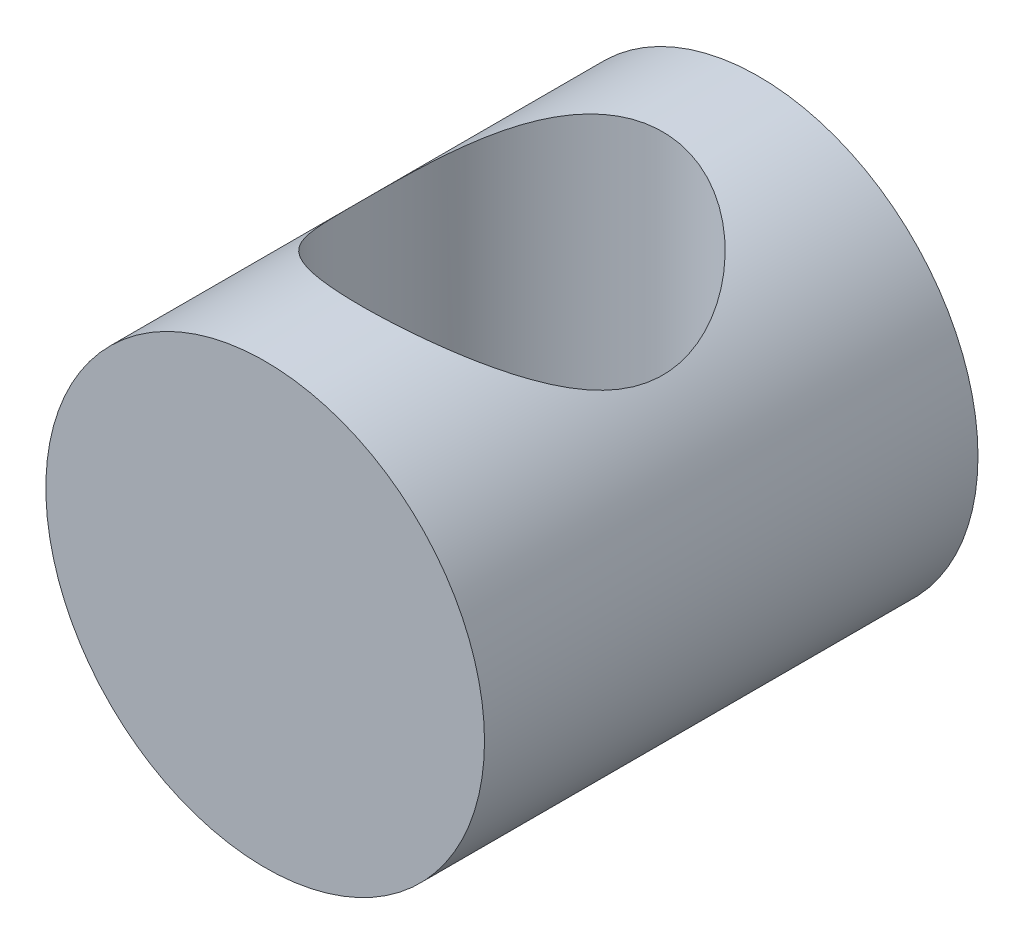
from build123d import *

# Parameters (mm, degrees)
SKETCH_1_R          = 8
EXTRUDE_1_DEPTH     = 18
SKETCH_3_R          = 5.5
CUT_EXTRUDE_1_DEPTH = 10


with BuildPart() as part:
    # Sketch 1 → Extrude 1 (new body)
    with BuildSketch(Plane(origin=(0, 0, 0), x_dir=(0, -1, 0), z_dir=(0, 0, 1))):
        with Locations(Location((0, 0, 0), (0, 0, 90))):
            Circle(SKETCH_1_R)
    extrude(amount=EXTRUDE_1_DEPTH)

    # Sketch 3 → Cut-Extrude 1 (cut, symmetric)
    with BuildSketch(Plane(origin=(0, 0, 0), x_dir=(1, 0, 0), z_dir=(0, 1, 0))):
        with Locations(Location((0, -9, 0), (0, 0, 270))):
            Circle(SKETCH_3_R)
    extrude(amount=CUT_EXTRUDE_1_DEPTH, both=True, mode=Mode.SUBTRACT)


solid = part.part
